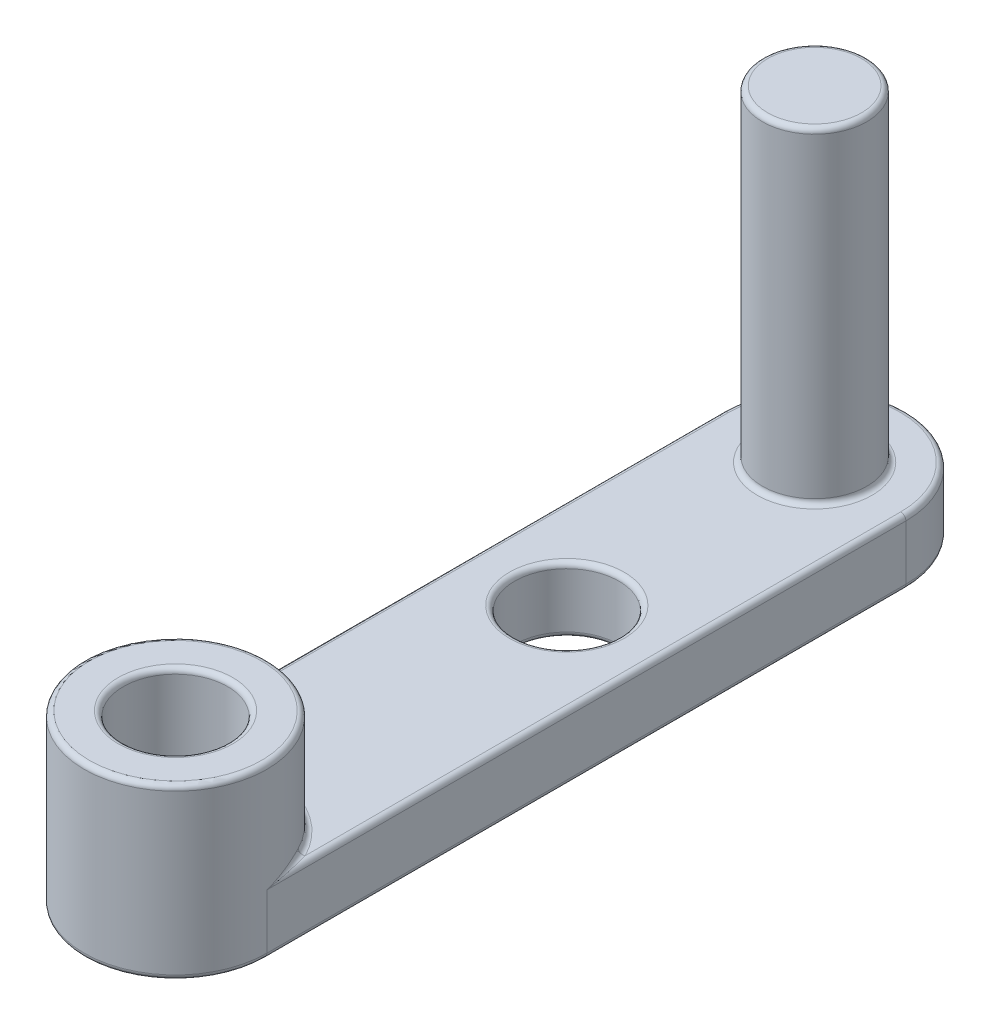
ISO-10303-21;
HEADER;
FILE_DESCRIPTION(('STEP AP214'),'2;1');
FILE_NAME('part.step','',(''),(''),'','','');
FILE_SCHEMA(('AUTOMOTIVE_DESIGN { 1 0 10303 214 1 1 1 1 }'));
ENDSEC;
DATA;
#1=APPLICATION_CONTEXT('core data for automotive mechanical design processes');
#2=APPLICATION_PROTOCOL_DEFINITION('international standard','automotive_design',2000,#1);
#3=PRODUCT_CONTEXT('',#1,'mechanical');
#4=PRODUCT('Part','Part','',(#3));
#5=PRODUCT_RELATED_PRODUCT_CATEGORY('part','',(#4));
#6=PRODUCT_DEFINITION_FORMATION('','',#4);
#7=PRODUCT_DEFINITION_CONTEXT('part definition',#1,'design');
#8=PRODUCT_DEFINITION('design','',#6,#7);
#9=PRODUCT_DEFINITION_SHAPE('','',#8);
#10=(LENGTH_UNIT() NAMED_UNIT(*) SI_UNIT(.MILLI.,.METRE.));
#11=(NAMED_UNIT(*) PLANE_ANGLE_UNIT() SI_UNIT($,.RADIAN.));
#12=(NAMED_UNIT(*) SI_UNIT($,.STERADIAN.) SOLID_ANGLE_UNIT());
#13=UNCERTAINTY_MEASURE_WITH_UNIT(LENGTH_MEASURE(1.E-05),#10,'distance_accuracy_value','');
#14=(GEOMETRIC_REPRESENTATION_CONTEXT(3) GLOBAL_UNCERTAINTY_ASSIGNED_CONTEXT((#13)) GLOBAL_UNIT_ASSIGNED_CONTEXT((#10,
#11,#12)) REPRESENTATION_CONTEXT('',''));
#15=CARTESIAN_POINT('',(0.,0.,0.));
#16=DIRECTION('',(0.,0.,1.));
#17=DIRECTION('',(1.,0.,0.));
#18=AXIS2_PLACEMENT_3D('',#15,#16,#17);
#19=CARTESIAN_POINT('',(0.,2.5,0.));
#20=DIRECTION('',(0.,1.,0.));
#21=DIRECTION('',(0.,0.,1.));
#22=AXIS2_PLACEMENT_3D('',#19,#20,#21);
#23=PLANE('',#22);
#24=CARTESIAN_POINT('',(0.,2.5,-24.5));
#25=DIRECTION('',(0.,1.,0.));
#26=DIRECTION('',(0.,0.,1.));
#27=AXIS2_PLACEMENT_3D('',#24,#25,#26);
#28=CIRCLE('',#27,2.2);
#29=CARTESIAN_POINT('',(0.,2.5,-22.3));
#30=VERTEX_POINT('',#29);
#31=EDGE_CURVE('E347',#30,#30,#28,.F.);
#32=ORIENTED_EDGE('',*,*,#31,.T.);
#33=EDGE_LOOP('',(#32));
#34=FACE_BOUND('',#33,.T.);
#35=CARTESIAN_POINT('',(0.,2.5,-24.5));
#36=DIRECTION('',(0.,1.,0.));
#37=DIRECTION('',(0.,0.,1.));
#38=AXIS2_PLACEMENT_3D('',#35,#36,#37);
#39=CIRCLE('',#38,3.3);
#40=CARTESIAN_POINT('',(3.3,2.5,-24.5));
#41=VERTEX_POINT('',#40);
#42=CARTESIAN_POINT('',(-3.3,2.5,-24.5));
#43=VERTEX_POINT('',#42);
#44=EDGE_CURVE('E59',#41,#43,#39,.T.);
#45=ORIENTED_EDGE('',*,*,#44,.T.);
#46=DIRECTION('',(0.,0.,1.));
#47=VECTOR('',#46,1.);
#48=CARTESIAN_POINT('',(-3.3,2.5,0.));
#49=LINE('',#48,#47);
#50=CARTESIAN_POINT('',(-3.29999999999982,2.5,-1.67332005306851));
#51=VERTEX_POINT('',#50);
#52=EDGE_CURVE('E345',#43,#51,#49,.T.);
#53=ORIENTED_EDGE('',*,*,#52,.T.);
#54=CARTESIAN_POINT('',(0.,2.5,0.));
#55=DIRECTION('',(0.,1.,0.));
#56=DIRECTION('',(0.,0.,1.));
#57=AXIS2_PLACEMENT_3D('',#54,#55,#56);
#58=CIRCLE('',#57,3.7);
#59=CARTESIAN_POINT('',(3.29999999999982,2.5,-1.67332005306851));
#60=VERTEX_POINT('',#59);
#61=EDGE_CURVE('E341',#51,#60,#58,.F.);
#62=ORIENTED_EDGE('',*,*,#61,.T.);
#63=DIRECTION('',(0.,0.,-1.));
#64=VECTOR('',#63,1.);
#65=CARTESIAN_POINT('',(3.3,2.5,-24.5));
#66=LINE('',#65,#64);
#67=EDGE_CURVE('E64',#60,#41,#66,.T.);
#68=ORIENTED_EDGE('',*,*,#67,.T.);
#69=EDGE_LOOP('',(#45,#53,#62,#68));
#70=FACE_BOUND('',#69,.T.);
#71=CARTESIAN_POINT('',(0.,2.5,-15.));
#72=DIRECTION('',(0.,1.,0.));
#73=DIRECTION('',(0.,0.,1.));
#74=AXIS2_PLACEMENT_3D('',#71,#72,#73);
#75=CIRCLE('',#74,2.2);
#76=CARTESIAN_POINT('',(0.,2.5,-12.8));
#77=VERTEX_POINT('',#76);
#78=EDGE_CURVE('E338',#77,#77,#75,.F.);
#79=ORIENTED_EDGE('',*,*,#78,.T.);
#80=EDGE_LOOP('',(#79));
#81=FACE_BOUND('',#80,.T.);
#82=ADVANCED_FACE('F37',(#34,#70,#81),#23,.T.);
#83=CARTESIAN_POINT('',(0.,2.5,0.));
#84=DIRECTION('',(0.,-1.,0.));
#85=DIRECTION('',(0.,0.,-1.));
#86=AXIS2_PLACEMENT_3D('',#83,#84,#85);
#87=CYLINDRICAL_SURFACE('',#86,3.5);
#88=CARTESIAN_POINT('',(0.,6.3,0.));
#89=DIRECTION('',(0.,1.,0.));
#90=DIRECTION('',(0.,0.,1.));
#91=AXIS2_PLACEMENT_3D('',#88,#89,#90);
#92=CIRCLE('',#91,3.5);
#93=CARTESIAN_POINT('',(0.,6.3,3.5));
#94=VERTEX_POINT('',#93);
#95=EDGE_CURVE('E325',#94,#94,#92,.F.);
#96=ORIENTED_EDGE('',*,*,#95,.T.);
#97=EDGE_LOOP('',(#96));
#98=FACE_BOUND('',#97,.T.);
#99=DIRECTION('',(0.,-1.,0.));
#100=VECTOR('',#99,1.);
#101=CARTESIAN_POINT('',(-3.5,2.5,0.));
#102=LINE('',#101,#100);
#103=CARTESIAN_POINT('',(-3.5,2.3,0.));
#104=VERTEX_POINT('',#103);
#105=CARTESIAN_POINT('',(-3.5,0.2,0.));
#106=VERTEX_POINT('',#105);
#107=EDGE_CURVE('E291',#104,#106,#102,.T.);
#108=ORIENTED_EDGE('',*,*,#107,.T.);
#109=CARTESIAN_POINT('',(0.,0.2,0.));
#110=DIRECTION('',(0.,1.,0.));
#111=DIRECTION('',(0.,0.,1.));
#112=AXIS2_PLACEMENT_3D('',#109,#110,#111);
#113=CIRCLE('',#112,3.5);
#114=CARTESIAN_POINT('',(3.5,0.2,0.));
#115=VERTEX_POINT('',#114);
#116=EDGE_CURVE('E330',#106,#115,#113,.T.);
#117=ORIENTED_EDGE('',*,*,#116,.T.);
#118=DIRECTION('',(0.,-1.,0.));
#119=VECTOR('',#118,1.);
#120=CARTESIAN_POINT('',(3.5,2.5,0.));
#121=LINE('',#120,#119);
#122=CARTESIAN_POINT('',(3.5,2.3,0.));
#123=VERTEX_POINT('',#122);
#124=EDGE_CURVE('E136',#123,#115,#121,.T.);
#125=ORIENTED_EDGE('',*,*,#124,.F.);
#126=CARTESIAN_POINT('',(3.19987985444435,2.47313565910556,-2.02026972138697));
#127=CARTESIAN_POINT('',(3.12415649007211,2.42934667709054,-1.95441329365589));
#128=CARTESIAN_POINT('',(3.0371813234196,2.48560340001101,-1.91892986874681));
#129=CARTESIAN_POINT('',(2.95020615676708,2.54186012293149,-1.88344644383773));
#130=CARTESIAN_POINT('',(2.93220513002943,2.6462713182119,-1.91106595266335));
#131=CARTESIAN_POINT('',(3.2077300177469,2.47766275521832,-1.99618659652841));
#132=CARTESIAN_POINT('',(3.13033815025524,2.43748831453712,-1.93356189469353));
#133=CARTESIAN_POINT('',(3.04647611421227,2.49472905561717,-1.8987300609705));
#134=CARTESIAN_POINT('',(2.96252221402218,2.55188975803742,-1.86409209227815));
#135=CARTESIAN_POINT('',(2.94705679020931,2.65532551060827,-1.8882846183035));
#136=CARTESIAN_POINT('',(3.21554359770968,2.48148382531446,-1.97158909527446));
#137=CARTESIAN_POINT('',(3.13707788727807,2.44499559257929,-1.91177374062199));
#138=CARTESIAN_POINT('',(3.05617835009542,2.50293891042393,-1.87767638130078));
#139=CARTESIAN_POINT('',(2.97519209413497,2.56081997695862,-1.84376694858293));
#140=CARTESIAN_POINT('',(2.96183923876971,2.66296765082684,-1.86501671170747));
#141=CARTESIAN_POINT('',(3.23100151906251,2.48790972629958,-1.92161207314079));
#142=CARTESIAN_POINT('',(3.15127549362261,2.4586483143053,-1.8669083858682));
#143=CARTESIAN_POINT('',(3.07606642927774,2.51762963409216,-1.83423583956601));
#144=CARTESIAN_POINT('',(3.0007746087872,2.57654803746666,-1.80174552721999));
#145=CARTESIAN_POINT('',(2.99108395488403,2.67581945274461,-1.81774115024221));
#146=CARTESIAN_POINT('',(3.23864611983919,2.49051656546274,-1.8962339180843));
#147=CARTESIAN_POINT('',(3.1587302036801,2.46481140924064,-1.8438312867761));
#148=CARTESIAN_POINT('',(3.08625144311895,2.52411335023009,-1.81185124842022));
#149=CARTESIAN_POINT('',(3.01369214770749,2.58337189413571,-1.78005099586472));
#150=CARTESIAN_POINT('',(3.00554671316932,2.68103313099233,-1.7937347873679));
#151=CARTESIAN_POINT('',(3.26112792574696,2.49680072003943,-1.81949523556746));
#152=CARTESIAN_POINT('',(3.18152507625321,2.4811800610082,-1.77368045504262));
#153=CARTESIAN_POINT('',(3.11695607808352,2.5410982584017,-1.74344146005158));
#154=CARTESIAN_POINT('',(3.05207201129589,2.60083990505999,-1.71390374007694));
#155=CARTESIAN_POINT('',(3.04807985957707,2.69360144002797,-1.72114414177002));
#156=CARTESIAN_POINT('',(3.27561302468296,2.49899299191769,-1.76722515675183));
#157=CARTESIAN_POINT('',(3.19756508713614,2.48957079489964,-1.72484020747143));
#158=CARTESIAN_POINT('',(3.13774899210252,2.54924393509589,-1.69589995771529));
#159=CARTESIAN_POINT('',(3.07766554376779,2.60884115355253,-1.66759781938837));
#160=CARTESIAN_POINT('',(3.07548410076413,2.69798598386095,-1.67169947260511));
#161=CARTESIAN_POINT('',(3.29300927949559,2.49990895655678,-1.70068252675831));
#162=CARTESIAN_POINT('',(3.21784709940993,2.49729063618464,-1.66177672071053));
#163=CARTESIAN_POINT('',(3.16343354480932,2.55622583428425,-1.63465525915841));
#164=CARTESIAN_POINT('',(3.10900213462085,2.61515700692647,-1.60757621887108));
#165=CARTESIAN_POINT('',(3.1083959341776,2.69981791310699,-1.60875374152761));
#166=CARTESIAN_POINT('',(3.29652580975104,2.4999995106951,-1.68702381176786));
#167=CARTESIAN_POINT('',(3.22197914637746,2.49871470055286,-1.64886158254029));
#168=CARTESIAN_POINT('',(3.16866476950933,2.55748284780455,-1.62204649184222));
#169=CARTESIAN_POINT('',(3.11533356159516,2.61624813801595,-1.59527243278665));
#170=CARTESIAN_POINT('',(3.11504882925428,2.69999902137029,-1.5958333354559));
#171=CARTESIAN_POINT('',(3.3134833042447,2.50000189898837,-1.62013587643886));
#172=CARTESIAN_POINT('',(3.24203282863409,2.50494941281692,-1.5857672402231));
#173=CARTESIAN_POINT('',(3.19405895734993,2.56283141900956,-1.56013570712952));
#174=CARTESIAN_POINT('',(3.14583559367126,2.62065822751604,-1.53511244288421));
#175=CARTESIAN_POINT('',(3.14713057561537,2.70000379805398,-1.53256096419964));
#176=CARTESIAN_POINT('',(3.32632887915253,2.49864723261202,-1.56627324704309));
#177=CARTESIAN_POINT('',(3.25800351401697,2.50784653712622,-1.53425206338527));
#178=CARTESIAN_POINT('',(3.21382037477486,2.56465591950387,-1.50977494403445));
#179=CARTESIAN_POINT('',(3.16943737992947,2.62146386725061,-1.48583431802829));
#180=CARTESIAN_POINT('',(3.17143301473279,2.69729446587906,-1.48160982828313));
#181=CARTESIAN_POINT('',(3.35064521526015,2.49387663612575,-1.45766191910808));
#182=CARTESIAN_POINT('',(3.2890346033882,2.51011409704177,-1.42989190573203));
#183=CARTESIAN_POINT('',(3.25184250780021,2.5644066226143,-1.40756210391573));
#184=CARTESIAN_POINT('',(3.21445205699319,2.61870316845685,-1.38576629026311));
#185=CARTESIAN_POINT('',(3.21743689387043,2.68775327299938,-1.37886938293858));
#186=CARTESIAN_POINT('',(3.36211427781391,2.49045818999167,-1.40291221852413));
#187=CARTESIAN_POINT('',(3.30412943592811,2.50951878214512,-1.3769714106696));
#188=CARTESIAN_POINT('',(3.2701013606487,2.56232806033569,-1.3557082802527));
#189=CARTESIAN_POINT('',(3.23592285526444,2.61517460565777,-1.33490614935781));
#190=CARTESIAN_POINT('',(3.23913512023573,2.680916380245,-1.32707912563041));
#191=CARTESIAN_POINT('',(3.39449171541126,2.47779774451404,-1.23735785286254));
#192=CARTESIAN_POINT('',(3.34728366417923,2.50346047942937,-1.21721426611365));
#193=CARTESIAN_POINT('',(3.32221328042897,2.55141827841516,-1.19823946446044));
#194=CARTESIAN_POINT('',(3.29653039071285,2.59949287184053,-1.18110274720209));
#195=CARTESIAN_POINT('',(3.30038973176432,2.65559548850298,-1.17047364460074));
#196=CARTESIAN_POINT('',(3.41327907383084,2.46615760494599,-1.1256096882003));
#197=CARTESIAN_POINT('',(3.37367095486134,2.49377263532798,-1.10790309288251));
#198=CARTESIAN_POINT('',(3.35326022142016,2.53789560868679,-1.09105524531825));
#199=CARTESIAN_POINT('',(3.33252562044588,2.58222075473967,-1.07551922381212));
#200=CARTESIAN_POINT('',(3.33593338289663,2.632315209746,-1.06476592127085));
#201=CARTESIAN_POINT('',(3.44666230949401,2.43787140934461,-0.891164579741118));
#202=CARTESIAN_POINT('',(3.42111803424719,2.46588467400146,-0.878515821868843));
#203=CARTESIAN_POINT('',(3.40897993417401,2.50153174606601,-0.865253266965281));
#204=CARTESIAN_POINT('',(3.39646436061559,2.53743503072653,-0.853521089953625));
#205=CARTESIAN_POINT('',(3.39909085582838,2.57574281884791,-0.842993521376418));
#206=CARTESIAN_POINT('',(3.46075085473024,2.42087775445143,-0.768361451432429));
#207=CARTESIAN_POINT('',(3.44177716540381,2.44703175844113,-0.757590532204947));
#208=CARTESIAN_POINT('',(3.43286241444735,2.47798175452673,-0.746452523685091));
#209=CARTESIAN_POINT('',(3.42380139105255,2.50913464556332,-0.736253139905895));
#210=CARTESIAN_POINT('',(3.42574486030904,2.54175550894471,-0.726828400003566));
#211=CARTESIAN_POINT('',(3.48254070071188,2.38442911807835,-0.522261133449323));
#212=CARTESIAN_POINT('',(3.47383749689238,2.40451017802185,-0.515451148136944));
#213=CARTESIAN_POINT('',(3.46997786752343,2.4257556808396,-0.507853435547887));
#214=CARTESIAN_POINT('',(3.46597529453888,2.44720522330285,-0.501176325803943));
#215=CARTESIAN_POINT('',(3.46696889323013,2.46885823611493,-0.494030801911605));
#216=CARTESIAN_POINT('',(3.49025458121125,2.36497907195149,-0.398965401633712));
#217=CARTESIAN_POINT('',(3.48540295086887,2.38078928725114,-0.393676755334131));
#218=CARTESIAN_POINT('',(3.48323181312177,2.39708983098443,-0.388057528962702));
#219=CARTESIAN_POINT('',(3.48103135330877,2.41348379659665,-0.382826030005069));
#220=CARTESIAN_POINT('',(3.48156272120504,2.42995814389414,-0.377399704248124));
#221=CARTESIAN_POINT('',(3.49814694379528,2.33082786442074,-0.187586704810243));
#222=CARTESIAN_POINT('',(3.49721378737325,2.3385471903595,-0.185148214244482));
#223=CARTESIAN_POINT('',(3.49680579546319,2.34623503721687,-0.182514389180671));
#224=CARTESIAN_POINT('',(3.49638763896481,2.35397264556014,-0.180074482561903));
#225=CARTESIAN_POINT('',(3.49649421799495,2.36165572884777,-0.177446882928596));
#226=CARTESIAN_POINT('',(3.49985357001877,2.31636765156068,-0.0995633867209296));
#227=CARTESIAN_POINT('',(3.49978012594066,2.32046008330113,-0.098221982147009));
#228=CARTESIAN_POINT('',(3.49974763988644,2.3245511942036,-0.0968723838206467));
#229=CARTESIAN_POINT('',(3.49971485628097,2.32864439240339,-0.0955309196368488));
#230=CARTESIAN_POINT('',(3.49972297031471,2.33273530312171,-0.094181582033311));
#231=CARTESIAN_POINT('',(3.49999699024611,2.30126662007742,-0.00770454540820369));
#232=CARTESIAN_POINT('',(3.49999549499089,2.30158327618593,-0.00760043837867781));
#233=CARTESIAN_POINT('',(3.499994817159,2.30189993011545,-0.00749631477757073));
#234=CARTESIAN_POINT('',(3.49999415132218,2.30221658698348,-0.00739220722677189));
#235=CARTESIAN_POINT('',(3.49999430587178,2.30253324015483,-0.00728808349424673));
#236=CARTESIAN_POINT('',(3.49999999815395,2.30063330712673,-0.00385225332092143));
#237=CARTESIAN_POINT('',(3.5000000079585,2.30079163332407,-0.00380019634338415));
#238=CARTESIAN_POINT('',(3.50000000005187,2.30094996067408,-0.00374813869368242));
#239=CARTESIAN_POINT('',(3.50000000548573,2.30110828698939,-0.0036960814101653));
#240=CARTESIAN_POINT('',(3.49999999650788,2.30126661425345,-0.00364402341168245));
#241=CARTESIAN_POINT('',(3.5,2.3,0.));
#242=CARTESIAN_POINT('',(3.5,2.3,0.));
#243=CARTESIAN_POINT('',(3.5,2.3,0.));
#244=CARTESIAN_POINT('',(3.5,2.3,0.));
#245=CARTESIAN_POINT('',(3.5,2.3,0.));
#246=(BOUNDED_SURFACE() B_SPLINE_SURFACE(3,2,((#126,#127,#128,#129,#130),(#131,#132,#133,#134,
#135),(#136,#137,#138,#139,#140),(#141,#142,#143,#144,#145),(#146,#147,#148,#149,#150),(#151,
#152,#153,#154,#155),(#156,#157,#158,#159,#160),(#161,#162,#163,#164,#165),(#166,#167,#168,#169,
#170),(#171,#172,#173,#174,#175),(#176,#177,#178,#179,#180),(#181,#182,#183,#184,#185),(#186,
#187,#188,#189,#190),(#191,#192,#193,#194,#195),(#196,#197,#198,#199,#200),(#201,#202,#203,#204,
#205),(#206,#207,#208,#209,#210),(#211,#212,#213,#214,#215),(#216,#217,#218,#219,#220),(#221,
#222,#223,#224,#225),(#226,#227,#228,#229,#230),(#231,#232,#233,#234,#235),(#236,#237,#238,#239,
#240),(#241,#242,#243,#244,#245)),.UNSPECIFIED.,.F.,.F.,.F.) B_SPLINE_SURFACE_WITH_KNOTS((4,2,2,
2,2,2,2,2,2,2,2,4),(3,2,3),(0.,0.0903059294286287,0.18046196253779,0.359648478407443,
0.405742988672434,0.584635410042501,0.763746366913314,1.12317238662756,1.5138911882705,
1.90383709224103,2.18175935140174,2.1939248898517),(0.,0.5,1.),
.UNSPECIFIED.) GEOMETRIC_REPRESENTATION_ITEM() RATIONAL_B_SPLINE_SURFACE(((1.,0.87715441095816,
1.,0.87715441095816,1.),(1.,0.881220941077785,1.,0.881220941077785,1.),(1.,0.885147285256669,1.,
0.885147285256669,1.),(1.,0.892721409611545,1.,0.892721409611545,1.),(1.,0.896369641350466,1.,
0.896369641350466,1.),(1.,0.906875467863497,1.,0.906875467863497,1.),(1.,0.913344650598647,1.,
0.913344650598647,1.),(1.,0.920885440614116,1.,0.920885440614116,1.),(1.,0.922397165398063,1.,
0.922397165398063,1.),(1.,0.9296325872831,1.,0.9296325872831,1.),(1.,0.934943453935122,1.,
0.934943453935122,1.),(1.,0.944786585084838,1.,0.944786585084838,1.),(1.,0.949317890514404,1.,
0.949317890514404,1.),(1.,0.961907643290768,1.,0.961907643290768,1.),(1.,0.96892450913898,1.,
0.96892450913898,1.),(1.,0.981182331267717,1.,0.981182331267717,1.),(1.,0.986215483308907,1.,
0.986215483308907,1.),(1.,0.993930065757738,1.,0.993930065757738,1.),(1.,0.996616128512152,1.,
0.996616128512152,1.),(1.,0.999358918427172,1.,0.999358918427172,1.),(1.,0.99994932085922,1.,
0.99994932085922,1.),(1.,0.999998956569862,1.,0.999998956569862,1.),(1.,0.999999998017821,1.,
0.999999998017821,1.),(1.,1.,1.,1.,1.))) REPRESENTATION_ITEM('') SURFACE());
#247=CARTESIAN_POINT('',(2.93220513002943,2.6462713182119,-1.91106595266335));
#248=CARTESIAN_POINT('',(2.94705679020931,2.65532551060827,-1.8882846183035));
#249=CARTESIAN_POINT('',(2.96183923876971,2.66296765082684,-1.86501671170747));
#250=CARTESIAN_POINT('',(2.99108395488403,2.67581945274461,-1.81774115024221));
#251=CARTESIAN_POINT('',(3.00554671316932,2.68103313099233,-1.7937347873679));
#252=CARTESIAN_POINT('',(3.04807985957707,2.69360144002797,-1.72114414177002));
#253=CARTESIAN_POINT('',(3.07548410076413,2.69798598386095,-1.67169947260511));
#254=CARTESIAN_POINT('',(3.1083959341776,2.69981791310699,-1.60875374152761));
#255=CARTESIAN_POINT('',(3.11504882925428,2.69999902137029,-1.5958333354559));
#256=CARTESIAN_POINT('',(3.14713057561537,2.70000379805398,-1.53256096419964));
#257=CARTESIAN_POINT('',(3.1714330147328,2.69729446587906,-1.48160982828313));
#258=CARTESIAN_POINT('',(3.21743689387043,2.68775327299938,-1.37886938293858));
#259=CARTESIAN_POINT('',(3.23913512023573,2.680916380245,-1.32707912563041));
#260=CARTESIAN_POINT('',(3.30038973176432,2.65559548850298,-1.17047364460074));
#261=CARTESIAN_POINT('',(3.33593338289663,2.632315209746,-1.06476592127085));
#262=CARTESIAN_POINT('',(3.39909085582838,2.57574281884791,-0.842993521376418));
#263=CARTESIAN_POINT('',(3.42574486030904,2.54175550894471,-0.726828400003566));
#264=CARTESIAN_POINT('',(3.46696889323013,2.46885823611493,-0.494030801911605));
#265=CARTESIAN_POINT('',(3.48156272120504,2.42995814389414,-0.377399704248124));
#266=CARTESIAN_POINT('',(3.49649421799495,2.36165572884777,-0.177446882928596));
#267=CARTESIAN_POINT('',(3.49972297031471,2.33273530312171,-0.0941815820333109));
#268=CARTESIAN_POINT('',(3.49999430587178,2.30253324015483,-0.00728808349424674));
#269=CARTESIAN_POINT('',(3.49999999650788,2.30126661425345,-0.00364402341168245));
#270=CARTESIAN_POINT('',(3.5,2.3,0.));
#271=B_SPLINE_CURVE_WITH_KNOTS('',3,(#247,#248,#249,#250,#251,#252,#253,#254,#255,#256,#257,
#258,#259,#260,#261,#262,#263,#264,#265,#266,#267,#268,#269,#270),.UNSPECIFIED.,.F.,.F.,(4,2,2,
2,2,2,2,2,2,2,2,4),(0.,0.0903059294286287,0.18046196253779,0.359648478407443,0.405742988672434,
0.584635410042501,0.763746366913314,1.12317238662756,1.5138911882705,1.90383709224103,
2.18175935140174,2.1939248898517),.UNSPECIFIED.);
#272=CARTESIAN_POINT('',(3.12162162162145,2.7,-1.58287032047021));
#273=VERTEX_POINT('',#272);
#274=EDGE_CURVE('E51',#123,#273,#271,.F.);
#275=ORIENTED_EDGE('',*,*,#274,.T.);
#276=CARTESIAN_POINT('',(0.,2.7,0.));
#277=DIRECTION('',(0.,1.,0.));
#278=DIRECTION('',(0.,0.,1.));
#279=AXIS2_PLACEMENT_3D('',#276,#277,#278);
#280=CIRCLE('',#279,3.5);
#281=CARTESIAN_POINT('',(-3.12162162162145,2.7,-1.58287032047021));
#282=VERTEX_POINT('',#281);
#283=EDGE_CURVE('E328',#273,#282,#280,.T.);
#284=ORIENTED_EDGE('',*,*,#283,.T.);
#285=CARTESIAN_POINT('',(-2.93220513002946,2.64627131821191,-1.91106595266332));
#286=CARTESIAN_POINT('',(-2.9502061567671,2.5418601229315,-1.8834464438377));
#287=CARTESIAN_POINT('',(-3.03718132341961,2.48560340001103,-1.91892986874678));
#288=CARTESIAN_POINT('',(-3.12415649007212,2.42934667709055,-1.95441329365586));
#289=CARTESIAN_POINT('',(-3.19987985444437,2.47313565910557,-2.02026972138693));
#290=CARTESIAN_POINT('',(-2.94705679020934,2.65532551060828,-1.88828461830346));
#291=CARTESIAN_POINT('',(-2.9625222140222,2.55188975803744,-1.86409209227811));
#292=CARTESIAN_POINT('',(-3.04647611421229,2.49472905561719,-1.89873006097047));
#293=CARTESIAN_POINT('',(-3.13033815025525,2.43748831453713,-1.93356189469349));
#294=CARTESIAN_POINT('',(-3.20773001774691,2.47766275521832,-1.99618659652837));
#295=CARTESIAN_POINT('',(-2.96183923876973,2.66296765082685,-1.86501671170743));
#296=CARTESIAN_POINT('',(-2.97519209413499,2.56081997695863,-1.8437669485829));
#297=CARTESIAN_POINT('',(-3.05617835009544,2.50293891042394,-1.87767638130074));
#298=CARTESIAN_POINT('',(-3.13707788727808,2.4449955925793,-1.91177374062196));
#299=CARTESIAN_POINT('',(-3.2155435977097,2.48148382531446,-1.97158909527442));
#300=CARTESIAN_POINT('',(-2.99108395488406,2.67581945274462,-1.81774115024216));
#301=CARTESIAN_POINT('',(-3.00077460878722,2.57654803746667,-1.80174552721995));
#302=CARTESIAN_POINT('',(-3.07606642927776,2.51762963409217,-1.83423583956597));
#303=CARTESIAN_POINT('',(-3.15127549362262,2.45864831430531,-1.86690838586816));
#304=CARTESIAN_POINT('',(-3.23100151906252,2.48790972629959,-1.92161207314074));
#305=CARTESIAN_POINT('',(-3.00554671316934,2.68103313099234,-1.79373478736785));
#306=CARTESIAN_POINT('',(-3.01369214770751,2.58337189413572,-1.78005099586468));
#307=CARTESIAN_POINT('',(-3.08625144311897,2.5241133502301,-1.81185124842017));
#308=CARTESIAN_POINT('',(-3.15873020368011,2.46481140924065,-1.84383128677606));
#309=CARTESIAN_POINT('',(-3.23864611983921,2.49051656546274,-1.89623391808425));
#310=CARTESIAN_POINT('',(-3.0480798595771,2.69360144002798,-1.72114414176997));
#311=CARTESIAN_POINT('',(-3.05207201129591,2.60083990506,-1.71390374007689));
#312=CARTESIAN_POINT('',(-3.11695607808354,2.54109825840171,-1.74344146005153));
#313=CARTESIAN_POINT('',(-3.18152507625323,2.48118006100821,-1.77368045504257));
#314=CARTESIAN_POINT('',(-3.26112792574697,2.49680072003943,-1.8194952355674));
#315=CARTESIAN_POINT('',(-3.07548410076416,2.69798598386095,-1.67169947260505));
#316=CARTESIAN_POINT('',(-3.07766554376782,2.60884115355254,-1.66759781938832));
#317=CARTESIAN_POINT('',(-3.13774899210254,2.5492439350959,-1.69589995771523));
#318=CARTESIAN_POINT('',(-3.19756508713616,2.48957079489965,-1.72484020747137));
#319=CARTESIAN_POINT('',(-3.27561302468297,2.49899299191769,-1.76722515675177));
#320=CARTESIAN_POINT('',(-3.10839593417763,2.69981791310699,-1.60875374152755));
#321=CARTESIAN_POINT('',(-3.10900213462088,2.61515700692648,-1.60757621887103));
#322=CARTESIAN_POINT('',(-3.16343354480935,2.55622583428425,-1.63465525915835));
#323=CARTESIAN_POINT('',(-3.21784709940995,2.49729063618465,-1.66177672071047));
#324=CARTESIAN_POINT('',(-3.2930092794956,2.49990895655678,-1.70068252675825));
#325=CARTESIAN_POINT('',(-3.1150488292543,2.69999902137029,-1.59583333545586));
#326=CARTESIAN_POINT('',(-3.11533356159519,2.61624813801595,-1.5952724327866));
#327=CARTESIAN_POINT('',(-3.16866476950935,2.55748284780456,-1.62204649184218));
#328=CARTESIAN_POINT('',(-3.22197914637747,2.49871470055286,-1.64886158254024));
#329=CARTESIAN_POINT('',(-3.29652580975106,2.4999995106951,-1.68702381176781));
#330=CARTESIAN_POINT('',(-3.14713057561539,2.70000379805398,-1.5325609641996));
#331=CARTESIAN_POINT('',(-3.14583559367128,2.62065822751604,-1.53511244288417));
#332=CARTESIAN_POINT('',(-3.19405895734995,2.56283141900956,-1.56013570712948));
#333=CARTESIAN_POINT('',(-3.2420328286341,2.50494941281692,-1.58576724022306));
#334=CARTESIAN_POINT('',(-3.31348330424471,2.50000189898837,-1.62013587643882));
#335=CARTESIAN_POINT('',(-3.17143301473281,2.69729446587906,-1.48160982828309));
#336=CARTESIAN_POINT('',(-3.16943737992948,2.62146386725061,-1.48583431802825));
#337=CARTESIAN_POINT('',(-3.21382037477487,2.56465591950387,-1.50977494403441));
#338=CARTESIAN_POINT('',(-3.25800351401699,2.50784653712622,-1.53425206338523));
#339=CARTESIAN_POINT('',(-3.32632887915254,2.49864723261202,-1.56627324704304));
#340=CARTESIAN_POINT('',(-3.21743689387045,2.68775327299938,-1.37886938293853));
#341=CARTESIAN_POINT('',(-3.21445205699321,2.61870316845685,-1.38576629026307));
#342=CARTESIAN_POINT('',(-3.25184250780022,2.5644066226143,-1.40756210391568));
#343=CARTESIAN_POINT('',(-3.28903460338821,2.51011409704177,-1.42989190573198));
#344=CARTESIAN_POINT('',(-3.35064521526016,2.49387663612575,-1.45766191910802));
#345=CARTESIAN_POINT('',(-3.23913512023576,2.68091638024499,-1.32707912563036));
#346=CARTESIAN_POINT('',(-3.23592285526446,2.61517460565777,-1.33490614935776));
#347=CARTESIAN_POINT('',(-3.27010136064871,2.56232806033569,-1.35570828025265));
#348=CARTESIAN_POINT('',(-3.30412943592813,2.50951878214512,-1.37697141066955));
#349=CARTESIAN_POINT('',(-3.36211427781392,2.49045818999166,-1.40291221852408));
#350=CARTESIAN_POINT('',(-3.30038973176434,2.65559548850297,-1.17047364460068));
#351=CARTESIAN_POINT('',(-3.29653039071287,2.59949287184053,-1.18110274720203));
#352=CARTESIAN_POINT('',(-3.32221328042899,2.55141827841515,-1.19823946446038));
#353=CARTESIAN_POINT('',(-3.34728366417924,2.50346047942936,-1.21721426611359));
#354=CARTESIAN_POINT('',(-3.39449171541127,2.47779774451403,-1.23735785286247));
#355=CARTESIAN_POINT('',(-3.33593338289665,2.63231520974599,-1.06476592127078));
#356=CARTESIAN_POINT('',(-3.33252562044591,2.58222075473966,-1.07551922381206));
#357=CARTESIAN_POINT('',(-3.35326022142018,2.53789560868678,-1.09105524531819));
#358=CARTESIAN_POINT('',(-3.37367095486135,2.49377263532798,-1.10790309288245));
#359=CARTESIAN_POINT('',(-3.41327907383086,2.46615760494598,-1.12560968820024));
#360=CARTESIAN_POINT('',(-3.39909085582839,2.57574281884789,-0.842993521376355));
#361=CARTESIAN_POINT('',(-3.3964643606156,2.53743503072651,-0.853521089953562));
#362=CARTESIAN_POINT('',(-3.40897993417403,2.501531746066,-0.865253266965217));
#363=CARTESIAN_POINT('',(-3.4211180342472,2.46588467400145,-0.878515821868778));
#364=CARTESIAN_POINT('',(-3.44666230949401,2.4378714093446,-0.891164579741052));
#365=CARTESIAN_POINT('',(-3.42574486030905,2.54175550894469,-0.726828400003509));
#366=CARTESIAN_POINT('',(-3.42380139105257,2.5091346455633,-0.736253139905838));
#367=CARTESIAN_POINT('',(-3.43286241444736,2.47798175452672,-0.746452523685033));
#368=CARTESIAN_POINT('',(-3.44177716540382,2.44703175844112,-0.757590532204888));
#369=CARTESIAN_POINT('',(-3.46075085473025,2.42087775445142,-0.768361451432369));
#370=CARTESIAN_POINT('',(-3.46696889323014,2.46885823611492,-0.49403080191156));
#371=CARTESIAN_POINT('',(-3.46597529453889,2.44720522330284,-0.501176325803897));
#372=CARTESIAN_POINT('',(-3.46997786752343,2.42575568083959,-0.50785343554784));
#373=CARTESIAN_POINT('',(-3.47383749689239,2.40451017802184,-0.515451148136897));
#374=CARTESIAN_POINT('',(-3.48254070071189,2.38442911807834,-0.522261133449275));
#375=CARTESIAN_POINT('',(-3.48156272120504,2.42995814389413,-0.377399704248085));
#376=CARTESIAN_POINT('',(-3.48103135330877,2.41348379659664,-0.38282603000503));
#377=CARTESIAN_POINT('',(-3.48323181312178,2.39708983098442,-0.388057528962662));
#378=CARTESIAN_POINT('',(-3.48540295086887,2.38078928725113,-0.393676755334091));
#379=CARTESIAN_POINT('',(-3.49025458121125,2.36497907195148,-0.398965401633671));
#380=CARTESIAN_POINT('',(-3.49649421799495,2.36165572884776,-0.177446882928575));
#381=CARTESIAN_POINT('',(-3.49638763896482,2.35397264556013,-0.180074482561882));
#382=CARTESIAN_POINT('',(-3.4968057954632,2.34623503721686,-0.18251438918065));
#383=CARTESIAN_POINT('',(-3.49721378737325,2.3385471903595,-0.18514821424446));
#384=CARTESIAN_POINT('',(-3.49814694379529,2.33082786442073,-0.187586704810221));
#385=CARTESIAN_POINT('',(-3.49972297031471,2.3327353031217,-0.094181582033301));
#386=CARTESIAN_POINT('',(-3.49971485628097,2.32864439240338,-0.0955309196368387));
#387=CARTESIAN_POINT('',(-3.49974763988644,2.3245511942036,-0.0968723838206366));
#388=CARTESIAN_POINT('',(-3.49978012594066,2.32046008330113,-0.0982219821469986));
#389=CARTESIAN_POINT('',(-3.49985357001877,2.31636765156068,-0.0995633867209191));
#390=CARTESIAN_POINT('',(-3.49999430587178,2.30253324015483,-0.0072880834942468));
#391=CARTESIAN_POINT('',(-3.49999415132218,2.30221658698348,-0.00739220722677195));
#392=CARTESIAN_POINT('',(-3.499994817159,2.30189993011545,-0.00749631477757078));
#393=CARTESIAN_POINT('',(-3.49999549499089,2.30158327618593,-0.00760043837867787));
#394=CARTESIAN_POINT('',(-3.49999699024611,2.30126662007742,-0.00770454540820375));
#395=CARTESIAN_POINT('',(-3.49999999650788,2.30126661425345,-0.00364402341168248));
#396=CARTESIAN_POINT('',(-3.50000000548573,2.30110828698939,-0.00369608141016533));
#397=CARTESIAN_POINT('',(-3.50000000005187,2.30094996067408,-0.00374813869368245));
#398=CARTESIAN_POINT('',(-3.5000000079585,2.30079163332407,-0.00380019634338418));
#399=CARTESIAN_POINT('',(-3.49999999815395,2.30063330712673,-0.00385225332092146));
#400=CARTESIAN_POINT('',(-3.5,2.3,0.));
#401=CARTESIAN_POINT('',(-3.5,2.3,0.));
#402=CARTESIAN_POINT('',(-3.5,2.3,0.));
#403=CARTESIAN_POINT('',(-3.5,2.3,0.));
#404=CARTESIAN_POINT('',(-3.5,2.3,0.));
#405=(BOUNDED_SURFACE() B_SPLINE_SURFACE(3,2,((#285,#286,#287,#288,#289),(#290,#291,#292,#293,
#294),(#295,#296,#297,#298,#299),(#300,#301,#302,#303,#304),(#305,#306,#307,#308,#309),(#310,
#311,#312,#313,#314),(#315,#316,#317,#318,#319),(#320,#321,#322,#323,#324),(#325,#326,#327,#328,
#329),(#330,#331,#332,#333,#334),(#335,#336,#337,#338,#339),(#340,#341,#342,#343,#344),(#345,
#346,#347,#348,#349),(#350,#351,#352,#353,#354),(#355,#356,#357,#358,#359),(#360,#361,#362,#363,
#364),(#365,#366,#367,#368,#369),(#370,#371,#372,#373,#374),(#375,#376,#377,#378,#379),(#380,
#381,#382,#383,#384),(#385,#386,#387,#388,#389),(#390,#391,#392,#393,#394),(#395,#396,#397,#398,
#399),(#400,#401,#402,#403,#404)),.UNSPECIFIED.,.F.,.F.,.F.) B_SPLINE_SURFACE_WITH_KNOTS((4,2,2,
2,2,2,2,2,2,2,2,4),(3,2,3),(0.,0.0903059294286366,0.180461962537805,0.359648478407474,
0.405742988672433,0.584635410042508,0.763746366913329,1.12317238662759,1.51389118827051,
1.90383709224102,2.18175935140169,2.19392488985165),(0.,0.5,1.),
.UNSPECIFIED.) GEOMETRIC_REPRESENTATION_ITEM() RATIONAL_B_SPLINE_SURFACE(((1.,0.877154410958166,
1.,0.877154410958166,1.),(1.,0.881220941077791,1.,0.881220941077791,1.),(1.,0.885147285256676,
1.,0.885147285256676,1.),(1.,0.892721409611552,1.,0.892721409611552,1.),(1.,0.896369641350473,
1.,0.896369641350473,1.),(1.,0.906875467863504,1.,0.906875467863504,1.),(1.,0.913344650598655,
1.,0.913344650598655,1.),(1.,0.920885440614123,1.,0.920885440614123,1.),(1.,0.922397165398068,
1.,0.922397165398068,1.),(1.,0.929632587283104,1.,0.929632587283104,1.),(1.,0.934943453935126,
1.,0.934943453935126,1.),(1.,0.944786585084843,1.,0.944786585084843,1.),(1.,0.949317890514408,
1.,0.949317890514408,1.),(1.,0.961907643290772,1.,0.961907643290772,1.),(1.,0.968924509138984,
1.,0.968924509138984,1.),(1.,0.98118233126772,1.,0.98118233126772,1.),(1.,0.98621548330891,1.,
0.98621548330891,1.),(1.,0.993930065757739,1.,0.993930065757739,1.),(1.,0.996616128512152,1.,
0.996616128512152,1.),(1.,0.999358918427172,1.,0.999358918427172,1.),(1.,0.999949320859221,1.,
0.999949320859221,1.),(1.,0.999998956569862,1.,0.999998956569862,1.),(1.,0.999999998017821,1.,
0.999999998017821,1.),(1.,1.,1.,1.,1.))) REPRESENTATION_ITEM('') SURFACE());
#406=CARTESIAN_POINT('',(-2.93220513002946,2.64627131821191,-1.91106595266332));
#407=CARTESIAN_POINT('',(-2.94705679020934,2.65532551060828,-1.88828461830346));
#408=CARTESIAN_POINT('',(-2.96183923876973,2.66296765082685,-1.86501671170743));
#409=CARTESIAN_POINT('',(-2.99108395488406,2.67581945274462,-1.81774115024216));
#410=CARTESIAN_POINT('',(-3.00554671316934,2.68103313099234,-1.79373478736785));
#411=CARTESIAN_POINT('',(-3.0480798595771,2.69360144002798,-1.72114414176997));
#412=CARTESIAN_POINT('',(-3.07548410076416,2.69798598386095,-1.67169947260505));
#413=CARTESIAN_POINT('',(-3.10839593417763,2.69981791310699,-1.60875374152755));
#414=CARTESIAN_POINT('',(-3.1150488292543,2.69999902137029,-1.59583333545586));
#415=CARTESIAN_POINT('',(-3.14713057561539,2.70000379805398,-1.5325609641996));
#416=CARTESIAN_POINT('',(-3.17143301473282,2.69729446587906,-1.48160982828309));
#417=CARTESIAN_POINT('',(-3.21743689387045,2.68775327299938,-1.37886938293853));
#418=CARTESIAN_POINT('',(-3.23913512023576,2.68091638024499,-1.32707912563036));
#419=CARTESIAN_POINT('',(-3.30038973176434,2.65559548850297,-1.17047364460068));
#420=CARTESIAN_POINT('',(-3.33593338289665,2.63231520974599,-1.06476592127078));
#421=CARTESIAN_POINT('',(-3.39909085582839,2.57574281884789,-0.842993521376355));
#422=CARTESIAN_POINT('',(-3.42574486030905,2.54175550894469,-0.726828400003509));
#423=CARTESIAN_POINT('',(-3.46696889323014,2.46885823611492,-0.49403080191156));
#424=CARTESIAN_POINT('',(-3.48156272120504,2.42995814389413,-0.377399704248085));
#425=CARTESIAN_POINT('',(-3.49649421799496,2.36165572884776,-0.177446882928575));
#426=CARTESIAN_POINT('',(-3.49972297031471,2.3327353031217,-0.0941815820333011));
#427=CARTESIAN_POINT('',(-3.49999430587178,2.30253324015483,-0.0072880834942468));
#428=CARTESIAN_POINT('',(-3.49999999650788,2.30126661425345,-0.00364402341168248));
#429=CARTESIAN_POINT('',(-3.5,2.3,0.));
#430=B_SPLINE_CURVE_WITH_KNOTS('',3,(#406,#407,#408,#409,#410,#411,#412,#413,#414,#415,#416,
#417,#418,#419,#420,#421,#422,#423,#424,#425,#426,#427,#428,#429),.UNSPECIFIED.,.F.,.F.,(4,2,2,
2,2,2,2,2,2,2,2,4),(0.,0.0903059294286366,0.180461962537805,0.359648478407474,0.405742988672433,
0.584635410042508,0.763746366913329,1.12317238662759,1.51389118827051,1.90383709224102,
2.18175935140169,2.19392488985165),.UNSPECIFIED.);
#431=EDGE_CURVE('E11',#282,#104,#430,.T.);
#432=ORIENTED_EDGE('',*,*,#431,.T.);
#433=EDGE_LOOP('',(#108,#117,#125,#275,#284,#432));
#434=FACE_BOUND('',#433,.T.);
#435=ADVANCED_FACE('F174',(#98,#434),#87,.T.);
#436=CARTESIAN_POINT('',(3.5,2.5,0.));
#437=DIRECTION('',(-1.,0.,0.));
#438=DIRECTION('',(0.,0.,1.));
#439=AXIS2_PLACEMENT_3D('',#436,#437,#438);
#440=PLANE('',#439);
#441=ORIENTED_EDGE('',*,*,#124,.T.);
#442=DIRECTION('',(0.,0.,-1.));
#443=VECTOR('',#442,1.);
#444=CARTESIAN_POINT('',(3.5,0.2,0.));
#445=LINE('',#444,#443);
#446=CARTESIAN_POINT('',(3.5,0.2,-24.5));
#447=VERTEX_POINT('',#446);
#448=EDGE_CURVE('E135',#115,#447,#445,.T.);
#449=ORIENTED_EDGE('',*,*,#448,.T.);
#450=DIRECTION('',(0.,-1.,0.));
#451=VECTOR('',#450,1.);
#452=CARTESIAN_POINT('',(3.5,2.5,-24.5));
#453=LINE('',#452,#451);
#454=CARTESIAN_POINT('',(3.5,2.3,-24.5));
#455=VERTEX_POINT('',#454);
#456=EDGE_CURVE('E118',#455,#447,#453,.T.);
#457=ORIENTED_EDGE('',*,*,#456,.F.);
#458=DIRECTION('',(0.,0.,-1.));
#459=VECTOR('',#458,1.);
#460=CARTESIAN_POINT('',(3.5,2.3,0.));
#461=LINE('',#460,#459);
#462=EDGE_CURVE('E132',#455,#123,#461,.F.);
#463=ORIENTED_EDGE('',*,*,#462,.T.);
#464=EDGE_LOOP('',(#441,#449,#457,#463));
#465=FACE_BOUND('',#464,.T.);
#466=ADVANCED_FACE('F131',(#465),#440,.F.);
#467=CARTESIAN_POINT('',(0.,2.5,-24.5));
#468=DIRECTION('',(0.,-1.,0.));
#469=DIRECTION('',(0.,0.,-1.));
#470=AXIS2_PLACEMENT_3D('',#467,#468,#469);
#471=CYLINDRICAL_SURFACE('',#470,3.5);
#472=ORIENTED_EDGE('',*,*,#456,.T.);
#473=CARTESIAN_POINT('',(0.,0.2,-24.5));
#474=DIRECTION('',(0.,1.,0.));
#475=DIRECTION('',(0.,0.,1.));
#476=AXIS2_PLACEMENT_3D('',#473,#474,#475);
#477=CIRCLE('',#476,3.5);
#478=CARTESIAN_POINT('',(-3.5,0.2,-24.5));
#479=VERTEX_POINT('',#478);
#480=EDGE_CURVE('E124',#447,#479,#477,.T.);
#481=ORIENTED_EDGE('',*,*,#480,.T.);
#482=DIRECTION('',(0.,-1.,0.));
#483=VECTOR('',#482,1.);
#484=CARTESIAN_POINT('',(-3.5,2.5,-24.5));
#485=LINE('',#484,#483);
#486=CARTESIAN_POINT('',(-3.5,2.3,-24.5));
#487=VERTEX_POINT('',#486);
#488=EDGE_CURVE('E120',#487,#479,#485,.T.);
#489=ORIENTED_EDGE('',*,*,#488,.F.);
#490=CARTESIAN_POINT('',(0.,2.3,-24.5));
#491=DIRECTION('',(0.,1.,0.));
#492=DIRECTION('',(0.,0.,1.));
#493=AXIS2_PLACEMENT_3D('',#490,#491,#492);
#494=CIRCLE('',#493,3.5);
#495=EDGE_CURVE('E115',#487,#455,#494,.F.);
#496=ORIENTED_EDGE('',*,*,#495,.T.);
#497=EDGE_LOOP('',(#472,#481,#489,#496));
#498=FACE_BOUND('',#497,.T.);
#499=ADVANCED_FACE('F117',(#498),#471,.T.);
#500=CARTESIAN_POINT('',(-3.5,2.5,0.));
#501=DIRECTION('',(1.,0.,0.));
#502=DIRECTION('',(0.,0.,-1.));
#503=AXIS2_PLACEMENT_3D('',#500,#501,#502);
#504=PLANE('',#503);
#505=ORIENTED_EDGE('',*,*,#488,.T.);
#506=DIRECTION('',(0.,0.,1.));
#507=VECTOR('',#506,1.);
#508=CARTESIAN_POINT('',(-3.5,0.2,0.));
#509=LINE('',#508,#507);
#510=EDGE_CURVE('E323',#479,#106,#509,.T.);
#511=ORIENTED_EDGE('',*,*,#510,.T.);
#512=ORIENTED_EDGE('',*,*,#107,.F.);
#513=DIRECTION('',(0.,0.,1.));
#514=VECTOR('',#513,1.);
#515=CARTESIAN_POINT('',(-3.5,2.3,-24.5));
#516=LINE('',#515,#514);
#517=EDGE_CURVE('E320',#104,#487,#516,.F.);
#518=ORIENTED_EDGE('',*,*,#517,.T.);
#519=EDGE_LOOP('',(#505,#511,#512,#518));
#520=FACE_BOUND('',#519,.T.);
#521=ADVANCED_FACE('F390',(#520),#504,.F.);
#522=CARTESIAN_POINT('',(0.,0.,0.));
#523=DIRECTION('',(0.,1.,0.));
#524=DIRECTION('',(0.,0.,1.));
#525=AXIS2_PLACEMENT_3D('',#522,#523,#524);
#526=PLANE('',#525);
#527=CARTESIAN_POINT('',(0.,0.,-24.5));
#528=DIRECTION('',(0.,1.,0.));
#529=DIRECTION('',(0.,0.,1.));
#530=AXIS2_PLACEMENT_3D('',#527,#528,#529);
#531=CIRCLE('',#530,3.3);
#532=CARTESIAN_POINT('',(-3.3,0.,-24.5));
#533=VERTEX_POINT('',#532);
#534=CARTESIAN_POINT('',(3.3,0.,-24.5));
#535=VERTEX_POINT('',#534);
#536=EDGE_CURVE('E316',#533,#535,#531,.F.);
#537=ORIENTED_EDGE('',*,*,#536,.T.);
#538=DIRECTION('',(0.,0.,-1.));
#539=VECTOR('',#538,1.);
#540=CARTESIAN_POINT('',(3.3,0.,0.));
#541=LINE('',#540,#539);
#542=CARTESIAN_POINT('',(3.3,0.,0.));
#543=VERTEX_POINT('',#542);
#544=EDGE_CURVE('E125',#535,#543,#541,.F.);
#545=ORIENTED_EDGE('',*,*,#544,.T.);
#546=CARTESIAN_POINT('',(0.,0.,0.));
#547=DIRECTION('',(0.,1.,0.));
#548=DIRECTION('',(0.,0.,1.));
#549=AXIS2_PLACEMENT_3D('',#546,#547,#548);
#550=CIRCLE('',#549,3.3);
#551=CARTESIAN_POINT('',(-3.3,0.,0.));
#552=VERTEX_POINT('',#551);
#553=EDGE_CURVE('E312',#543,#552,#550,.F.);
#554=ORIENTED_EDGE('',*,*,#553,.T.);
#555=DIRECTION('',(0.,0.,1.));
#556=VECTOR('',#555,1.);
#557=CARTESIAN_POINT('',(-3.3,0.,0.));
#558=LINE('',#557,#556);
#559=EDGE_CURVE('E314',#552,#533,#558,.F.);
#560=ORIENTED_EDGE('',*,*,#559,.T.);
#561=EDGE_LOOP('',(#537,#545,#554,#560));
#562=FACE_BOUND('',#561,.T.);
#563=CARTESIAN_POINT('',(0.,0.,-15.));
#564=DIRECTION('',(0.,1.,0.));
#565=DIRECTION('',(0.,0.,1.));
#566=AXIS2_PLACEMENT_3D('',#563,#564,#565);
#567=CIRCLE('',#566,2.2);
#568=CARTESIAN_POINT('',(0.,0.,-12.8));
#569=VERTEX_POINT('',#568);
#570=EDGE_CURVE('E309',#569,#569,#567,.T.);
#571=ORIENTED_EDGE('',*,*,#570,.T.);
#572=EDGE_LOOP('',(#571));
#573=FACE_BOUND('',#572,.T.);
#574=ADVANCED_FACE('F386',(#562,#573),#526,.F.);
#575=CARTESIAN_POINT('',(0.,6.5,0.));
#576=DIRECTION('',(0.,1.,0.));
#577=DIRECTION('',(0.,0.,1.));
#578=AXIS2_PLACEMENT_3D('',#575,#576,#577);
#579=PLANE('',#578);
#580=CARTESIAN_POINT('',(0.,6.5,0.));
#581=DIRECTION('',(0.,1.,0.));
#582=DIRECTION('',(0.,0.,1.));
#583=AXIS2_PLACEMENT_3D('',#580,#581,#582);
#584=CIRCLE('',#583,2.2);
#585=CARTESIAN_POINT('',(0.,6.5,2.2));
#586=VERTEX_POINT('',#585);
#587=EDGE_CURVE('E197',#586,#586,#584,.F.);
#588=ORIENTED_EDGE('',*,*,#587,.T.);
#589=EDGE_LOOP('',(#588));
#590=FACE_BOUND('',#589,.T.);
#591=CARTESIAN_POINT('',(0.,6.5,0.));
#592=DIRECTION('',(0.,1.,0.));
#593=DIRECTION('',(0.,0.,1.));
#594=AXIS2_PLACEMENT_3D('',#591,#592,#593);
#595=CIRCLE('',#594,3.3);
#596=CARTESIAN_POINT('',(0.,6.5,3.3));
#597=VERTEX_POINT('',#596);
#598=EDGE_CURVE('E351',#597,#597,#595,.T.);
#599=ORIENTED_EDGE('',*,*,#598,.T.);
#600=EDGE_LOOP('',(#599));
#601=FACE_BOUND('',#600,.T.);
#602=ADVANCED_FACE('F284',(#590,#601),#579,.T.);
#603=CARTESIAN_POINT('',(0.,6.5,0.));
#604=DIRECTION('',(0.,-1.,0.));
#605=DIRECTION('',(0.,0.,-1.));
#606=AXIS2_PLACEMENT_3D('',#603,#604,#605);
#607=CYLINDRICAL_SURFACE('',#606,2.);
#608=CARTESIAN_POINT('',(0.,6.3,0.));
#609=DIRECTION('',(0.,1.,0.));
#610=DIRECTION('',(0.,0.,1.));
#611=AXIS2_PLACEMENT_3D('',#608,#609,#610);
#612=CIRCLE('',#611,2.);
#613=CARTESIAN_POINT('',(0.,6.3,2.));
#614=VERTEX_POINT('',#613);
#615=EDGE_CURVE('E349',#614,#614,#612,.T.);
#616=ORIENTED_EDGE('',*,*,#615,.T.);
#617=EDGE_LOOP('',(#616));
#618=FACE_BOUND('',#617,.T.);
#619=CARTESIAN_POINT('',(0.,2.5,0.));
#620=DIRECTION('',(0.,1.,0.));
#621=DIRECTION('',(0.,0.,1.));
#622=AXIS2_PLACEMENT_3D('',#619,#620,#621);
#623=CIRCLE('',#622,2.);
#624=CARTESIAN_POINT('',(0.,2.5,2.));
#625=VERTEX_POINT('',#624);
#626=EDGE_CURVE('E289',#625,#625,#623,.T.);
#627=ORIENTED_EDGE('',*,*,#626,.F.);
#628=EDGE_LOOP('',(#627));
#629=FACE_BOUND('',#628,.T.);
#630=ADVANCED_FACE('F275',(#618,#629),#607,.F.);
#631=ORIENTED_EDGE('',*,*,#626,.T.);
#632=EDGE_LOOP('',(#631));
#633=FACE_BOUND('',#632,.T.);
#634=ADVANCED_FACE('F267',(#633),#23,.T.);
#635=CARTESIAN_POINT('',(0.,15.,-24.5));
#636=DIRECTION('',(0.,-1.,0.));
#637=DIRECTION('',(0.,0.,-1.));
#638=AXIS2_PLACEMENT_3D('',#635,#636,#637);
#639=CYLINDRICAL_SURFACE('',#638,2.);
#640=CARTESIAN_POINT('',(0.,14.8,-24.5));
#641=DIRECTION('',(0.,1.,0.));
#642=DIRECTION('',(0.,0.,1.));
#643=AXIS2_PLACEMENT_3D('',#640,#641,#642);
#644=CIRCLE('',#643,2.);
#645=CARTESIAN_POINT('',(0.,14.8,-22.5));
#646=VERTEX_POINT('',#645);
#647=EDGE_CURVE('E144',#646,#646,#644,.F.);
#648=ORIENTED_EDGE('',*,*,#647,.T.);
#649=EDGE_LOOP('',(#648));
#650=FACE_BOUND('',#649,.T.);
#651=CARTESIAN_POINT('',(0.,2.7,-24.5));
#652=DIRECTION('',(0.,1.,0.));
#653=DIRECTION('',(0.,0.,1.));
#654=AXIS2_PLACEMENT_3D('',#651,#652,#653);
#655=CIRCLE('',#654,2.);
#656=CARTESIAN_POINT('',(0.,2.7,-22.5));
#657=VERTEX_POINT('',#656);
#658=EDGE_CURVE('E594',#657,#657,#655,.T.);
#659=ORIENTED_EDGE('',*,*,#658,.T.);
#660=EDGE_LOOP('',(#659));
#661=FACE_BOUND('',#660,.T.);
#662=ADVANCED_FACE('F274',(#650,#661),#639,.T.);
#663=CARTESIAN_POINT('',(0.,15.,-24.5));
#664=DIRECTION('',(0.,1.,0.));
#665=DIRECTION('',(0.,0.,1.));
#666=AXIS2_PLACEMENT_3D('',#663,#664,#665);
#667=PLANE('',#666);
#668=CARTESIAN_POINT('',(0.,15.,-24.5));
#669=DIRECTION('',(0.,1.,0.));
#670=DIRECTION('',(0.,0.,1.));
#671=AXIS2_PLACEMENT_3D('',#668,#669,#670);
#672=CIRCLE('',#671,1.8);
#673=CARTESIAN_POINT('',(0.,15.,-22.7));
#674=VERTEX_POINT('',#673);
#675=EDGE_CURVE('E305',#674,#674,#672,.T.);
#676=ORIENTED_EDGE('',*,*,#675,.T.);
#677=EDGE_LOOP('',(#676));
#678=FACE_BOUND('',#677,.T.);
#679=ADVANCED_FACE('F281',(#678),#667,.T.);
#680=CARTESIAN_POINT('',(0.,-2.49999999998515E-05,-15.));
#681=DIRECTION('',(0.,1.,0.));
#682=DIRECTION('',(0.,0.,1.));
#683=AXIS2_PLACEMENT_3D('',#680,#681,#682);
#684=CYLINDRICAL_SURFACE('',#683,2.);
#685=CARTESIAN_POINT('',(0.,0.2,-15.));
#686=DIRECTION('',(0.,1.,0.));
#687=DIRECTION('',(0.,0.,1.));
#688=AXIS2_PLACEMENT_3D('',#685,#686,#687);
#689=CIRCLE('',#688,2.);
#690=CARTESIAN_POINT('',(0.,0.2,-13.));
#691=VERTEX_POINT('',#690);
#692=EDGE_CURVE('E335',#691,#691,#689,.F.);
#693=ORIENTED_EDGE('',*,*,#692,.T.);
#694=EDGE_LOOP('',(#693));
#695=FACE_BOUND('',#694,.T.);
#696=CARTESIAN_POINT('',(0.,2.3,-15.));
#697=DIRECTION('',(0.,1.,0.));
#698=DIRECTION('',(0.,0.,1.));
#699=AXIS2_PLACEMENT_3D('',#696,#697,#698);
#700=CIRCLE('',#699,2.);
#701=CARTESIAN_POINT('',(0.,2.3,-13.));
#702=VERTEX_POINT('',#701);
#703=EDGE_CURVE('E332',#702,#702,#700,.T.);
#704=ORIENTED_EDGE('',*,*,#703,.T.);
#705=EDGE_LOOP('',(#704));
#706=FACE_BOUND('',#705,.T.);
#707=ADVANCED_FACE('F210',(#695,#706),#684,.F.);
#708=CARTESIAN_POINT('',(0.,14.8,-24.5));
#709=DIRECTION('',(0.,1.,0.));
#710=DIRECTION('',(0.,0.,1.));
#711=AXIS2_PLACEMENT_3D('',#708,#709,#710);
#712=TOROIDAL_SURFACE('',#711,1.8,0.2);
#713=ORIENTED_EDGE('',*,*,#647,.F.);
#714=EDGE_LOOP('',(#713));
#715=FACE_BOUND('',#714,.T.);
#716=ORIENTED_EDGE('',*,*,#675,.F.);
#717=EDGE_LOOP('',(#716));
#718=FACE_BOUND('',#717,.T.);
#719=ADVANCED_FACE('F206',(#715,#718),#712,.T.);
#720=CARTESIAN_POINT('',(-3.3,0.2,0.));
#721=DIRECTION('',(0.,0.,1.));
#722=DIRECTION('',(1.,0.,0.));
#723=AXIS2_PLACEMENT_3D('',#720,#721,#722);
#724=CYLINDRICAL_SURFACE('',#723,0.2);
#725=CARTESIAN_POINT('',(-3.3,0.2,-24.5));
#726=DIRECTION('',(0.,0.,-1.));
#727=DIRECTION('',(-1.,0.,0.));
#728=AXIS2_PLACEMENT_3D('',#725,#726,#727);
#729=CIRCLE('',#728,0.2);
#730=EDGE_CURVE('E296',#533,#479,#729,.T.);
#731=ORIENTED_EDGE('',*,*,#730,.F.);
#732=ORIENTED_EDGE('',*,*,#559,.F.);
#733=CARTESIAN_POINT('',(-3.3,0.2,0.));
#734=DIRECTION('',(0.,0.,1.));
#735=DIRECTION('',(1.,0.,0.));
#736=AXIS2_PLACEMENT_3D('',#733,#734,#735);
#737=CIRCLE('',#736,0.2);
#738=EDGE_CURVE('E240',#106,#552,#737,.T.);
#739=ORIENTED_EDGE('',*,*,#738,.F.);
#740=ORIENTED_EDGE('',*,*,#510,.F.);
#741=EDGE_LOOP('',(#731,#732,#739,#740));
#742=FACE_BOUND('',#741,.T.);
#743=ADVANCED_FACE('F209',(#742),#724,.T.);
#744=CARTESIAN_POINT('',(0.,0.2,0.));
#745=DIRECTION('',(0.,1.,0.));
#746=DIRECTION('',(0.,0.,1.));
#747=AXIS2_PLACEMENT_3D('',#744,#745,#746);
#748=TOROIDAL_SURFACE('',#747,3.3,0.2);
#749=ORIENTED_EDGE('',*,*,#738,.T.);
#750=ORIENTED_EDGE('',*,*,#553,.F.);
#751=CARTESIAN_POINT('',(3.3,0.2,0.));
#752=DIRECTION('',(0.,0.,-1.));
#753=DIRECTION('',(-1.,0.,0.));
#754=AXIS2_PLACEMENT_3D('',#751,#752,#753);
#755=CIRCLE('',#754,0.2);
#756=EDGE_CURVE('E580',#115,#543,#755,.T.);
#757=ORIENTED_EDGE('',*,*,#756,.F.);
#758=ORIENTED_EDGE('',*,*,#116,.F.);
#759=EDGE_LOOP('',(#749,#750,#757,#758));
#760=FACE_BOUND('',#759,.T.);
#761=ADVANCED_FACE('F220',(#760),#748,.T.);
#762=CARTESIAN_POINT('',(0.,0.2,-24.5));
#763=DIRECTION('',(0.,1.,0.));
#764=DIRECTION('',(0.,0.,1.));
#765=AXIS2_PLACEMENT_3D('',#762,#763,#764);
#766=TOROIDAL_SURFACE('',#765,3.3,0.2);
#767=ORIENTED_EDGE('',*,*,#730,.T.);
#768=ORIENTED_EDGE('',*,*,#480,.F.);
#769=CARTESIAN_POINT('',(3.3,0.2,-24.5));
#770=DIRECTION('',(0.,0.,1.));
#771=DIRECTION('',(1.,0.,0.));
#772=AXIS2_PLACEMENT_3D('',#769,#770,#771);
#773=CIRCLE('',#772,0.2);
#774=EDGE_CURVE('E161',#535,#447,#773,.T.);
#775=ORIENTED_EDGE('',*,*,#774,.F.);
#776=ORIENTED_EDGE('',*,*,#536,.F.);
#777=EDGE_LOOP('',(#767,#768,#775,#776));
#778=FACE_BOUND('',#777,.T.);
#779=ADVANCED_FACE('F216',(#778),#766,.T.);
#780=CARTESIAN_POINT('',(3.3,0.2,0.));
#781=DIRECTION('',(0.,0.,-1.));
#782=DIRECTION('',(-1.,0.,0.));
#783=AXIS2_PLACEMENT_3D('',#780,#781,#782);
#784=CYLINDRICAL_SURFACE('',#783,0.2);
#785=ORIENTED_EDGE('',*,*,#756,.T.);
#786=ORIENTED_EDGE('',*,*,#544,.F.);
#787=ORIENTED_EDGE('',*,*,#774,.T.);
#788=ORIENTED_EDGE('',*,*,#448,.F.);
#789=EDGE_LOOP('',(#785,#786,#787,#788));
#790=FACE_BOUND('',#789,.T.);
#791=ADVANCED_FACE('F212',(#790),#784,.T.);
#792=CARTESIAN_POINT('',(0.,0.2,-15.));
#793=DIRECTION('',(0.,1.,0.));
#794=DIRECTION('',(0.,0.,1.));
#795=AXIS2_PLACEMENT_3D('',#792,#793,#794);
#796=TOROIDAL_SURFACE('',#795,2.2,0.2);
#797=ORIENTED_EDGE('',*,*,#692,.F.);
#798=EDGE_LOOP('',(#797));
#799=FACE_BOUND('',#798,.T.);
#800=ORIENTED_EDGE('',*,*,#570,.F.);
#801=EDGE_LOOP('',(#800));
#802=FACE_BOUND('',#801,.T.);
#803=ADVANCED_FACE('F215',(#799,#802),#796,.T.);
#804=CARTESIAN_POINT('',(0.,2.7,-24.5));
#805=DIRECTION('',(0.,1.,0.));
#806=DIRECTION('',(0.,0.,1.));
#807=AXIS2_PLACEMENT_3D('',#804,#805,#806);
#808=TOROIDAL_SURFACE('',#807,2.2,0.2);
#809=ORIENTED_EDGE('',*,*,#31,.F.);
#810=EDGE_LOOP('',(#809));
#811=FACE_BOUND('',#810,.T.);
#812=ORIENTED_EDGE('',*,*,#658,.F.);
#813=EDGE_LOOP('',(#812));
#814=FACE_BOUND('',#813,.T.);
#815=ADVANCED_FACE('F170',(#811,#814),#808,.F.);
#816=CARTESIAN_POINT('',(3.29999999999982,2.7,-1.67332005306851));
#817=DIRECTION('',(0.452248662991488,0.,0.891891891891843));
#818=DIRECTION('',(0.891891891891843,0.,-0.452248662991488));
#819=AXIS2_PLACEMENT_3D('',#816,#817,#818);
#820=CIRCLE('',#819,0.2);
#821=EDGE_CURVE('E147',#273,#60,#820,.T.);
#822=ORIENTED_EDGE('',*,*,#821,.F.);
#823=ORIENTED_EDGE('',*,*,#274,.F.);
#824=CARTESIAN_POINT('',(3.19987985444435,2.47313565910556,-2.02026972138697));
#825=CARTESIAN_POINT('',(3.2077300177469,2.47766275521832,-1.99618659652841));
#826=CARTESIAN_POINT('',(3.21554359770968,2.48148382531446,-1.97158909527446));
#827=CARTESIAN_POINT('',(3.23100151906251,2.48790972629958,-1.92161207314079));
#828=CARTESIAN_POINT('',(3.23864611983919,2.49051656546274,-1.8962339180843));
#829=CARTESIAN_POINT('',(3.26112792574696,2.49680072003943,-1.81949523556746));
#830=CARTESIAN_POINT('',(3.27561302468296,2.49899299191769,-1.76722515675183));
#831=CARTESIAN_POINT('',(3.29300927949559,2.49990895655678,-1.70068252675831));
#832=CARTESIAN_POINT('',(3.29652580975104,2.4999995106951,-1.68702381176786));
#833=CARTESIAN_POINT('',(3.3134833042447,2.50000189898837,-1.62013587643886));
#834=CARTESIAN_POINT('',(3.32632887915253,2.49864723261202,-1.56627324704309));
#835=CARTESIAN_POINT('',(3.35064521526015,2.49387663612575,-1.45766191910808));
#836=CARTESIAN_POINT('',(3.36211427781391,2.49045818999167,-1.40291221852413));
#837=CARTESIAN_POINT('',(3.39449171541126,2.47779774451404,-1.23735785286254));
#838=CARTESIAN_POINT('',(3.41327907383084,2.46615760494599,-1.1256096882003));
#839=CARTESIAN_POINT('',(3.44666230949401,2.43787140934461,-0.891164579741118));
#840=CARTESIAN_POINT('',(3.46075085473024,2.42087775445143,-0.768361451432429));
#841=CARTESIAN_POINT('',(3.48254070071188,2.38442911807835,-0.522261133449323));
#842=CARTESIAN_POINT('',(3.49025458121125,2.36497907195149,-0.398965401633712));
#843=CARTESIAN_POINT('',(3.49814694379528,2.33082786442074,-0.187586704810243));
#844=CARTESIAN_POINT('',(3.49985357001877,2.31636765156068,-0.0995633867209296));
#845=CARTESIAN_POINT('',(3.49999699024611,2.30126662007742,-0.0077045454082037));
#846=CARTESIAN_POINT('',(3.49999999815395,2.30063330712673,-0.00385225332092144));
#847=CARTESIAN_POINT('',(3.5,2.3,0.));
#848=B_SPLINE_CURVE_WITH_KNOTS('',3,(#824,#825,#826,#827,#828,#829,#830,#831,#832,#833,#834,
#835,#836,#837,#838,#839,#840,#841,#842,#843,#844,#845,#846,#847),.UNSPECIFIED.,.F.,.F.,(4,2,2,
2,2,2,2,2,2,2,2,4),(0.,0.0903059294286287,0.18046196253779,0.359648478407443,0.405742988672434,
0.584635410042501,0.763746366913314,1.12317238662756,1.5138911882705,1.90383709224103,
2.18175935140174,2.1939248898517),.UNSPECIFIED.);
#849=EDGE_CURVE('E143',#60,#123,#848,.T.);
#850=ORIENTED_EDGE('',*,*,#849,.F.);
#851=EDGE_LOOP('',(#822,#823,#850));
#852=FACE_BOUND('',#851,.T.);
#853=ADVANCED_FACE('F166',(#852),#246,.F.);
#854=CARTESIAN_POINT('',(3.3,2.3,0.));
#855=DIRECTION('',(0.,0.,1.));
#856=DIRECTION('',(1.,0.,0.));
#857=AXIS2_PLACEMENT_3D('',#854,#855,#856);
#858=CYLINDRICAL_SURFACE('',#857,0.2);
#859=ORIENTED_EDGE('',*,*,#849,.T.);
#860=ORIENTED_EDGE('',*,*,#462,.F.);
#861=CARTESIAN_POINT('',(3.3,2.3,-24.5));
#862=DIRECTION('',(0.,0.,-1.));
#863=DIRECTION('',(-1.,0.,0.));
#864=AXIS2_PLACEMENT_3D('',#861,#862,#863);
#865=CIRCLE('',#864,0.2);
#866=EDGE_CURVE('E141',#41,#455,#865,.T.);
#867=ORIENTED_EDGE('',*,*,#866,.F.);
#868=ORIENTED_EDGE('',*,*,#67,.F.);
#869=EDGE_LOOP('',(#859,#860,#867,#868));
#870=FACE_BOUND('',#869,.T.);
#871=ADVANCED_FACE('F140',(#870),#858,.T.);
#872=CARTESIAN_POINT('',(0.,2.7,0.));
#873=DIRECTION('',(0.,1.,0.));
#874=DIRECTION('',(0.,0.,1.));
#875=AXIS2_PLACEMENT_3D('',#872,#873,#874);
#876=TOROIDAL_SURFACE('',#875,3.7,0.2);
#877=ORIENTED_EDGE('',*,*,#821,.T.);
#878=ORIENTED_EDGE('',*,*,#61,.F.);
#879=CARTESIAN_POINT('',(-3.29999999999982,2.7,-1.67332005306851));
#880=DIRECTION('',(0.452248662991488,0.,-0.891891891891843));
#881=DIRECTION('',(-0.891891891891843,0.,-0.452248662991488));
#882=AXIS2_PLACEMENT_3D('',#879,#880,#881);
#883=CIRCLE('',#882,0.2);
#884=EDGE_CURVE('E148',#282,#51,#883,.T.);
#885=ORIENTED_EDGE('',*,*,#884,.F.);
#886=ORIENTED_EDGE('',*,*,#283,.F.);
#887=EDGE_LOOP('',(#877,#878,#885,#886));
#888=FACE_BOUND('',#887,.T.);
#889=ADVANCED_FACE('F258',(#888),#876,.F.);
#890=CARTESIAN_POINT('',(0.,2.3,-24.5));
#891=DIRECTION('',(0.,1.,0.));
#892=DIRECTION('',(0.,0.,1.));
#893=AXIS2_PLACEMENT_3D('',#890,#891,#892);
#894=TOROIDAL_SURFACE('',#893,3.3,0.2);
#895=ORIENTED_EDGE('',*,*,#866,.T.);
#896=ORIENTED_EDGE('',*,*,#495,.F.);
#897=CARTESIAN_POINT('',(-3.3,2.3,-24.5));
#898=DIRECTION('',(0.,0.,1.));
#899=DIRECTION('',(1.,0.,0.));
#900=AXIS2_PLACEMENT_3D('',#897,#898,#899);
#901=CIRCLE('',#900,0.2);
#902=EDGE_CURVE('E153',#43,#487,#901,.T.);
#903=ORIENTED_EDGE('',*,*,#902,.F.);
#904=ORIENTED_EDGE('',*,*,#44,.F.);
#905=EDGE_LOOP('',(#895,#896,#903,#904));
#906=FACE_BOUND('',#905,.T.);
#907=ADVANCED_FACE('F146',(#906),#894,.T.);
#908=ORIENTED_EDGE('',*,*,#431,.F.);
#909=ORIENTED_EDGE('',*,*,#884,.T.);
#910=CARTESIAN_POINT('',(-3.19987985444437,2.47313565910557,-2.02026972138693));
#911=CARTESIAN_POINT('',(-3.20773001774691,2.47766275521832,-1.99618659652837));
#912=CARTESIAN_POINT('',(-3.2155435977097,2.48148382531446,-1.97158909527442));
#913=CARTESIAN_POINT('',(-3.23100151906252,2.48790972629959,-1.92161207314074));
#914=CARTESIAN_POINT('',(-3.23864611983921,2.49051656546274,-1.89623391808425));
#915=CARTESIAN_POINT('',(-3.26112792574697,2.49680072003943,-1.8194952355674));
#916=CARTESIAN_POINT('',(-3.27561302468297,2.49899299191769,-1.76722515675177));
#917=CARTESIAN_POINT('',(-3.2930092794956,2.49990895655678,-1.70068252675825));
#918=CARTESIAN_POINT('',(-3.29652580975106,2.4999995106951,-1.68702381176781));
#919=CARTESIAN_POINT('',(-3.31348330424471,2.50000189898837,-1.62013587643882));
#920=CARTESIAN_POINT('',(-3.32632887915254,2.49864723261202,-1.56627324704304));
#921=CARTESIAN_POINT('',(-3.35064521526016,2.49387663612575,-1.45766191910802));
#922=CARTESIAN_POINT('',(-3.36211427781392,2.49045818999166,-1.40291221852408));
#923=CARTESIAN_POINT('',(-3.39449171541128,2.47779774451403,-1.23735785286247));
#924=CARTESIAN_POINT('',(-3.41327907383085,2.46615760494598,-1.12560968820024));
#925=CARTESIAN_POINT('',(-3.44666230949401,2.4378714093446,-0.891164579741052));
#926=CARTESIAN_POINT('',(-3.46075085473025,2.42087775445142,-0.768361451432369));
#927=CARTESIAN_POINT('',(-3.48254070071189,2.38442911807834,-0.522261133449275));
#928=CARTESIAN_POINT('',(-3.49025458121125,2.36497907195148,-0.398965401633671));
#929=CARTESIAN_POINT('',(-3.49814694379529,2.33082786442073,-0.187586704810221));
#930=CARTESIAN_POINT('',(-3.49985357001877,2.31636765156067,-0.0995633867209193));
#931=CARTESIAN_POINT('',(-3.49999699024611,2.30126662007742,-0.00770454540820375));
#932=CARTESIAN_POINT('',(-3.49999999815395,2.30063330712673,-0.00385225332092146));
#933=CARTESIAN_POINT('',(-3.5,2.3,0.));
#934=B_SPLINE_CURVE_WITH_KNOTS('',3,(#910,#911,#912,#913,#914,#915,#916,#917,#918,#919,#920,
#921,#922,#923,#924,#925,#926,#927,#928,#929,#930,#931,#932,#933),.UNSPECIFIED.,.F.,.F.,(4,2,2,
2,2,2,2,2,2,2,2,4),(0.,0.0903059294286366,0.180461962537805,0.359648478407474,0.405742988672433,
0.584635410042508,0.763746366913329,1.12317238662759,1.51389118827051,1.90383709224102,
2.18175935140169,2.19392488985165),.UNSPECIFIED.);
#935=EDGE_CURVE('E235',#104,#51,#934,.F.);
#936=ORIENTED_EDGE('',*,*,#935,.F.);
#937=EDGE_LOOP('',(#908,#909,#936));
#938=FACE_BOUND('',#937,.T.);
#939=ADVANCED_FACE('F186',(#938),#405,.F.);
#940=CARTESIAN_POINT('',(-3.3,2.3,0.));
#941=DIRECTION('',(0.,0.,-1.));
#942=DIRECTION('',(-1.,0.,0.));
#943=AXIS2_PLACEMENT_3D('',#940,#941,#942);
#944=CYLINDRICAL_SURFACE('',#943,0.2);
#945=ORIENTED_EDGE('',*,*,#902,.T.);
#946=ORIENTED_EDGE('',*,*,#517,.F.);
#947=ORIENTED_EDGE('',*,*,#935,.T.);
#948=ORIENTED_EDGE('',*,*,#52,.F.);
#949=EDGE_LOOP('',(#945,#946,#947,#948));
#950=FACE_BOUND('',#949,.T.);
#951=ADVANCED_FACE('F248',(#950),#944,.T.);
#952=CARTESIAN_POINT('',(0.,2.3,-15.));
#953=DIRECTION('',(0.,1.,0.));
#954=DIRECTION('',(0.,0.,1.));
#955=AXIS2_PLACEMENT_3D('',#952,#953,#954);
#956=TOROIDAL_SURFACE('',#955,2.2,0.2);
#957=ORIENTED_EDGE('',*,*,#78,.F.);
#958=EDGE_LOOP('',(#957));
#959=FACE_BOUND('',#958,.T.);
#960=ORIENTED_EDGE('',*,*,#703,.F.);
#961=EDGE_LOOP('',(#960));
#962=FACE_BOUND('',#961,.T.);
#963=ADVANCED_FACE('F251',(#959,#962),#956,.T.);
#964=CARTESIAN_POINT('',(0.,6.3,0.));
#965=DIRECTION('',(0.,1.,0.));
#966=DIRECTION('',(0.,0.,1.));
#967=AXIS2_PLACEMENT_3D('',#964,#965,#966);
#968=TOROIDAL_SURFACE('',#967,2.2,0.2);
#969=ORIENTED_EDGE('',*,*,#587,.F.);
#970=EDGE_LOOP('',(#969));
#971=FACE_BOUND('',#970,.T.);
#972=ORIENTED_EDGE('',*,*,#615,.F.);
#973=EDGE_LOOP('',(#972));
#974=FACE_BOUND('',#973,.T.);
#975=ADVANCED_FACE('F359',(#971,#974),#968,.T.);
#976=CARTESIAN_POINT('',(0.,6.3,0.));
#977=DIRECTION('',(0.,1.,0.));
#978=DIRECTION('',(0.,0.,1.));
#979=AXIS2_PLACEMENT_3D('',#976,#977,#978);
#980=TOROIDAL_SURFACE('',#979,3.3,0.2);
#981=ORIENTED_EDGE('',*,*,#95,.F.);
#982=EDGE_LOOP('',(#981));
#983=FACE_BOUND('',#982,.T.);
#984=ORIENTED_EDGE('',*,*,#598,.F.);
#985=EDGE_LOOP('',(#984));
#986=FACE_BOUND('',#985,.T.);
#987=ADVANCED_FACE('F39',(#983,#986),#980,.T.);
#988=CLOSED_SHELL('',(#82,#435,#466,#499,#521,#574,#602,#630,#634,#662,#679,#707,#719,#743,#761,
#779,#791,#803,#815,#853,#871,#889,#907,#939,#951,#963,#975,#987));
#989=MANIFOLD_SOLID_BREP('B2',#988);
#990=ADVANCED_BREP_SHAPE_REPRESENTATION('',(#18,#989),#14);
#991=SHAPE_DEFINITION_REPRESENTATION(#9,#990);
ENDSEC;
END-ISO-10303-21;
